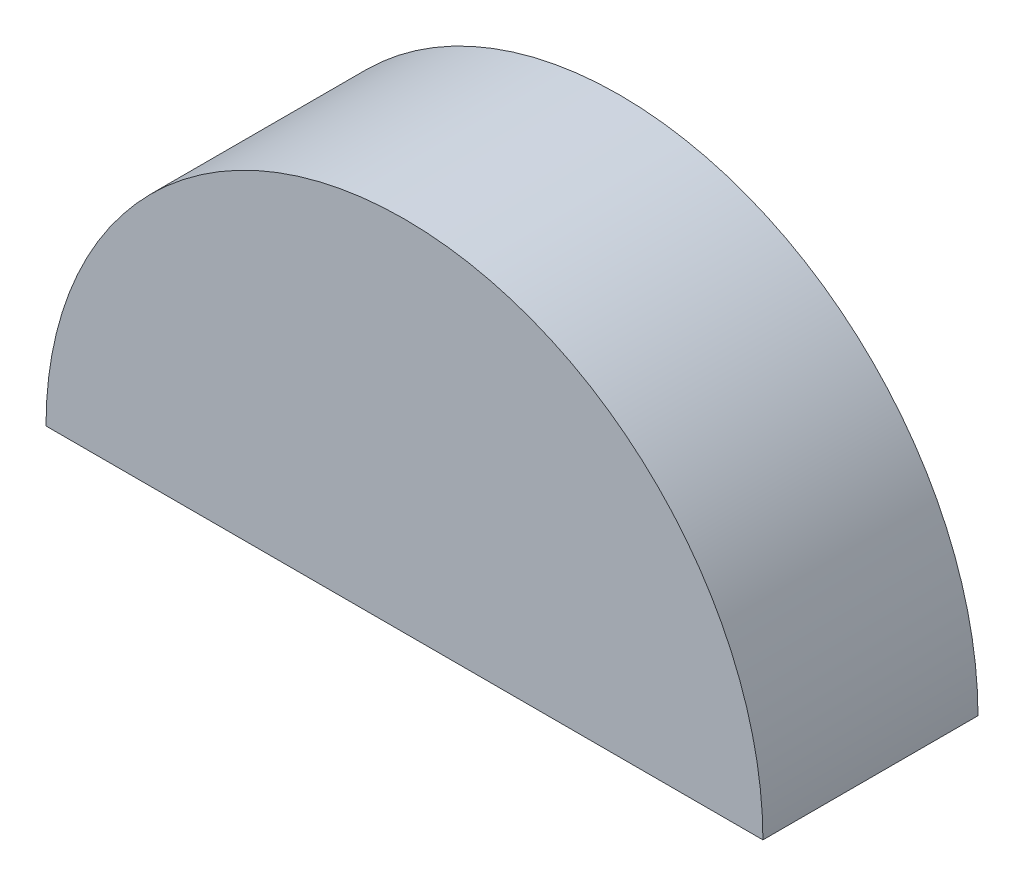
from build123d import *

# Parameters (mm, degrees)
BOSS_EXTRU_1_DEPTH = 3


with BuildPart() as part:
    # Esquisse1 → Boss.-Extru.1 (new body)
    with BuildSketch(Plane.XY):
        with BuildLine():
            Line((0, 0), (10, 0))
            ThreePointArc((10, 0), (5, 5), (0, 0))
        make_face()
    extrude(amount=BOSS_EXTRU_1_DEPTH)


solid = part.part
